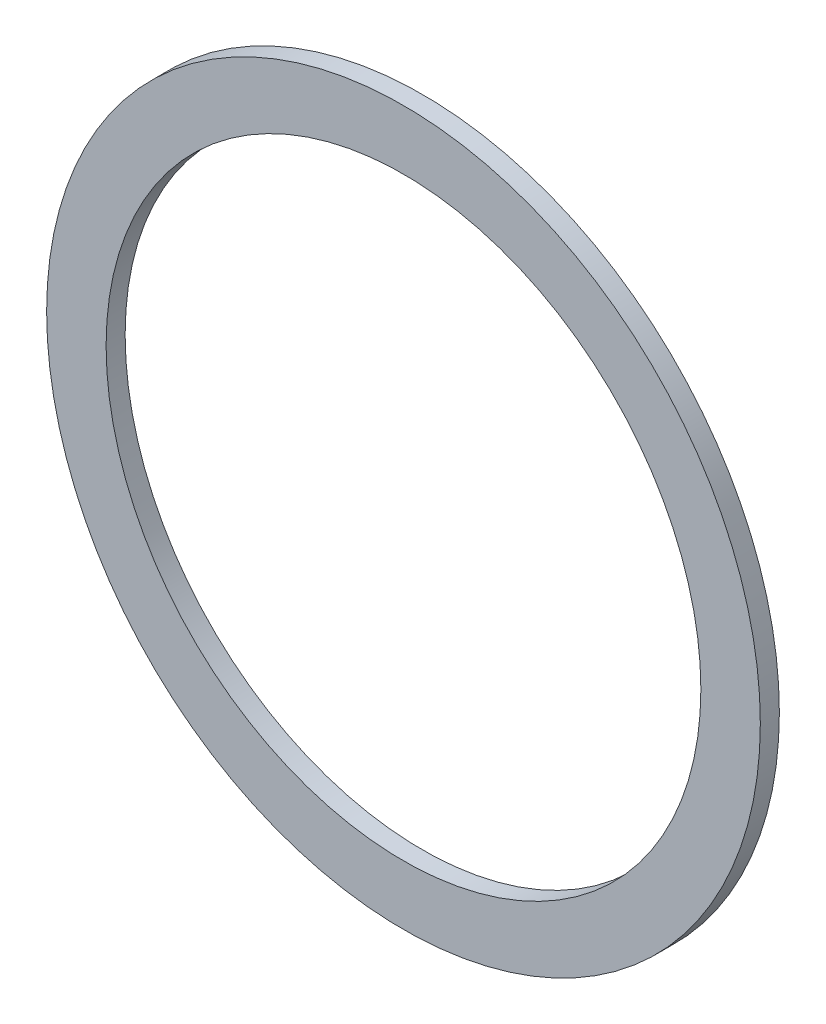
from build123d import *

# Parameters (mm, degrees)
ESQUISSE1_R        = 15
ESQUISSE1_R_2      = 12.5
BOSS_EXTRU_1_DEPTH = 0.8


with BuildPart() as part:
    # Esquisse1 → Boss.-Extru.1 (new body)
    with BuildSketch(Plane.XY):
        Circle(ESQUISSE1_R)
        Circle(ESQUISSE1_R_2, mode=Mode.SUBTRACT)
    extrude(amount=BOSS_EXTRU_1_DEPTH)


solid = part.part
